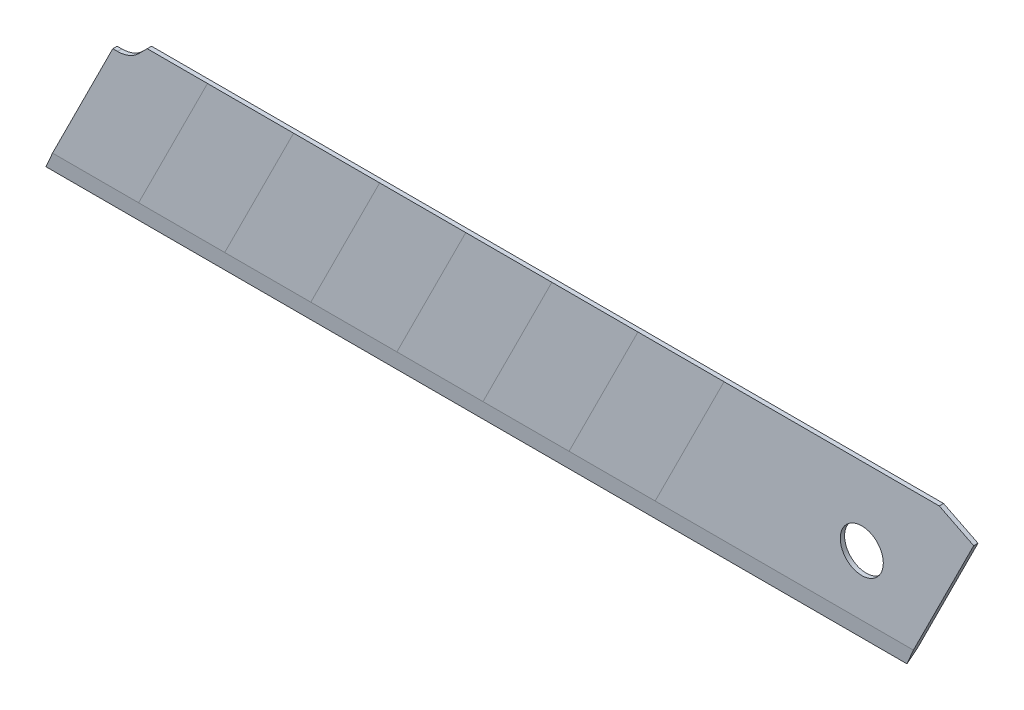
ISO-10303-21;
HEADER;
FILE_DESCRIPTION(('STEP AP214'),'2;1');
FILE_NAME('part.step','',(''),(''),'','','');
FILE_SCHEMA(('AUTOMOTIVE_DESIGN { 1 0 10303 214 1 1 1 1 }'));
ENDSEC;
DATA;
#1=APPLICATION_CONTEXT('core data for automotive mechanical design processes');
#2=APPLICATION_PROTOCOL_DEFINITION('international standard','automotive_design',2000,#1);
#3=PRODUCT_CONTEXT('',#1,'mechanical');
#4=PRODUCT('Part','Part','',(#3));
#5=PRODUCT_RELATED_PRODUCT_CATEGORY('part','',(#4));
#6=PRODUCT_DEFINITION_FORMATION('','',#4);
#7=PRODUCT_DEFINITION_CONTEXT('part definition',#1,'design');
#8=PRODUCT_DEFINITION('design','',#6,#7);
#9=PRODUCT_DEFINITION_SHAPE('','',#8);
#10=(LENGTH_UNIT() NAMED_UNIT(*) SI_UNIT(.MILLI.,.METRE.));
#11=(NAMED_UNIT(*) PLANE_ANGLE_UNIT() SI_UNIT($,.RADIAN.));
#12=(NAMED_UNIT(*) SI_UNIT($,.STERADIAN.) SOLID_ANGLE_UNIT());
#13=UNCERTAINTY_MEASURE_WITH_UNIT(LENGTH_MEASURE(1.E-05),#10,'distance_accuracy_value','');
#14=(GEOMETRIC_REPRESENTATION_CONTEXT(3) GLOBAL_UNCERTAINTY_ASSIGNED_CONTEXT((#13)) GLOBAL_UNIT_ASSIGNED_CONTEXT((#10,
#11,#12)) REPRESENTATION_CONTEXT('',''));
#15=CARTESIAN_POINT('',(0.,0.,0.));
#16=DIRECTION('',(0.,0.,1.));
#17=DIRECTION('',(1.,0.,0.));
#18=AXIS2_PLACEMENT_3D('',#15,#16,#17);
#19=CARTESIAN_POINT('',(0.,0.,0.5));
#20=DIRECTION('',(0.,0.,-1.));
#21=DIRECTION('',(-1.,0.,0.));
#22=AXIS2_PLACEMENT_3D('',#19,#20,#21);
#23=PLANE('',#22);
#24=DIRECTION('',(-0.447213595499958,-0.894427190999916,0.));
#25=VECTOR('',#24,1.);
#26=CARTESIAN_POINT('',(56.,-28.,0.5));
#27=LINE('',#26,#25);
#28=CARTESIAN_POINT('',(79.,18.,0.5));
#29=VERTEX_POINT('',#28);
#30=CARTESIAN_POINT('',(71.,2.00000000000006,0.5));
#31=VERTEX_POINT('',#30);
#32=EDGE_CURVE('E12',#29,#31,#27,.T.);
#33=ORIENTED_EDGE('',*,*,#32,.F.);
#34=DIRECTION('',(-1.,0.,0.));
#35=VECTOR('',#34,1.);
#36=CARTESIAN_POINT('',(9.,18.,0.5));
#37=LINE('',#36,#35);
#38=CARTESIAN_POINT('',(69.,18.,0.5));
#39=VERTEX_POINT('',#38);
#40=EDGE_CURVE('E218',#29,#39,#37,.T.);
#41=ORIENTED_EDGE('',*,*,#40,.T.);
#42=DIRECTION('',(-0.447213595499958,-0.894427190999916,0.));
#43=VECTOR('',#42,1.);
#44=CARTESIAN_POINT('',(48.,-24.,0.5));
#45=LINE('',#44,#43);
#46=CARTESIAN_POINT('',(61.,2.00000000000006,0.5));
#47=VERTEX_POINT('',#46);
#48=EDGE_CURVE('E45',#39,#47,#45,.T.);
#49=ORIENTED_EDGE('',*,*,#48,.T.);
#50=DIRECTION('',(1.,0.,0.));
#51=VECTOR('',#50,1.);
#52=CARTESIAN_POINT('',(0.,2.00000000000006,0.5));
#53=LINE('',#52,#51);
#54=EDGE_CURVE('E271',#47,#31,#53,.T.);
#55=ORIENTED_EDGE('',*,*,#54,.T.);
#56=EDGE_LOOP('',(#33,#41,#49,#55));
#57=FACE_BOUND('',#56,.T.);
#58=ADVANCED_FACE('F36',(#57),#23,.F.);
#59=ORIENTED_EDGE('',*,*,#48,.F.);
#60=CARTESIAN_POINT('',(59.,18.,0.5));
#61=VERTEX_POINT('',#60);
#62=EDGE_CURVE('E339',#39,#61,#37,.T.);
#63=ORIENTED_EDGE('',*,*,#62,.T.);
#64=DIRECTION('',(-0.447213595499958,-0.894427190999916,0.));
#65=VECTOR('',#64,1.);
#66=CARTESIAN_POINT('',(40.,-20.,0.5));
#67=LINE('',#66,#65);
#68=CARTESIAN_POINT('',(51.,2.00000000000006,0.5));
#69=VERTEX_POINT('',#68);
#70=EDGE_CURVE('E264',#61,#69,#67,.T.);
#71=ORIENTED_EDGE('',*,*,#70,.T.);
#72=EDGE_CURVE('E279',#69,#47,#53,.T.);
#73=ORIENTED_EDGE('',*,*,#72,.T.);
#74=EDGE_LOOP('',(#59,#63,#71,#73));
#75=FACE_BOUND('',#74,.T.);
#76=ADVANCED_FACE('F282',(#75),#23,.F.);
#77=ORIENTED_EDGE('',*,*,#70,.F.);
#78=CARTESIAN_POINT('',(49.,18.,0.5));
#79=VERTEX_POINT('',#78);
#80=EDGE_CURVE('E337',#61,#79,#37,.T.);
#81=ORIENTED_EDGE('',*,*,#80,.T.);
#82=DIRECTION('',(-0.447213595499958,-0.894427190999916,0.));
#83=VECTOR('',#82,1.);
#84=CARTESIAN_POINT('',(32.,-16.,0.5));
#85=LINE('',#84,#83);
#86=CARTESIAN_POINT('',(41.,2.00000000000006,0.5));
#87=VERTEX_POINT('',#86);
#88=EDGE_CURVE('E261',#79,#87,#85,.T.);
#89=ORIENTED_EDGE('',*,*,#88,.T.);
#90=EDGE_CURVE('E284',#87,#69,#53,.T.);
#91=ORIENTED_EDGE('',*,*,#90,.T.);
#92=EDGE_LOOP('',(#77,#81,#89,#91));
#93=FACE_BOUND('',#92,.T.);
#94=ADVANCED_FACE('F341',(#93),#23,.F.);
#95=ORIENTED_EDGE('',*,*,#88,.F.);
#96=CARTESIAN_POINT('',(39.,18.,0.5));
#97=VERTEX_POINT('',#96);
#98=EDGE_CURVE('E336',#79,#97,#37,.T.);
#99=ORIENTED_EDGE('',*,*,#98,.T.);
#100=DIRECTION('',(-0.447213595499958,-0.894427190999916,0.));
#101=VECTOR('',#100,1.);
#102=CARTESIAN_POINT('',(24.,-12.,0.5));
#103=LINE('',#102,#101);
#104=CARTESIAN_POINT('',(31.,2.00000000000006,0.5));
#105=VERTEX_POINT('',#104);
#106=EDGE_CURVE('E258',#97,#105,#103,.T.);
#107=ORIENTED_EDGE('',*,*,#106,.T.);
#108=EDGE_CURVE('E285',#105,#87,#53,.T.);
#109=ORIENTED_EDGE('',*,*,#108,.T.);
#110=EDGE_LOOP('',(#95,#99,#107,#109));
#111=FACE_BOUND('',#110,.T.);
#112=ADVANCED_FACE('F343',(#111),#23,.F.);
#113=ORIENTED_EDGE('',*,*,#106,.F.);
#114=CARTESIAN_POINT('',(29.,18.,0.5));
#115=VERTEX_POINT('',#114);
#116=EDGE_CURVE('E335',#97,#115,#37,.T.);
#117=ORIENTED_EDGE('',*,*,#116,.T.);
#118=DIRECTION('',(-0.447213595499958,-0.894427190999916,0.));
#119=VECTOR('',#118,1.);
#120=CARTESIAN_POINT('',(16.,-8.00000000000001,0.5));
#121=LINE('',#120,#119);
#122=CARTESIAN_POINT('',(21.,2.00000000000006,0.5));
#123=VERTEX_POINT('',#122);
#124=EDGE_CURVE('E255',#115,#123,#121,.T.);
#125=ORIENTED_EDGE('',*,*,#124,.T.);
#126=EDGE_CURVE('E288',#123,#105,#53,.T.);
#127=ORIENTED_EDGE('',*,*,#126,.T.);
#128=EDGE_LOOP('',(#113,#117,#125,#127));
#129=FACE_BOUND('',#128,.T.);
#130=ADVANCED_FACE('F349',(#129),#23,.F.);
#131=ORIENTED_EDGE('',*,*,#124,.F.);
#132=CARTESIAN_POINT('',(19.,18.,0.5));
#133=VERTEX_POINT('',#132);
#134=EDGE_CURVE('E334',#115,#133,#37,.T.);
#135=ORIENTED_EDGE('',*,*,#134,.T.);
#136=DIRECTION('',(-0.447213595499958,-0.894427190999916,0.));
#137=VECTOR('',#136,1.);
#138=CARTESIAN_POINT('',(8.,-4.,0.5));
#139=LINE('',#138,#137);
#140=CARTESIAN_POINT('',(11.,2.00000000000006,0.5));
#141=VERTEX_POINT('',#140);
#142=EDGE_CURVE('E251',#133,#141,#139,.T.);
#143=ORIENTED_EDGE('',*,*,#142,.T.);
#144=EDGE_CURVE('E252',#141,#123,#53,.T.);
#145=ORIENTED_EDGE('',*,*,#144,.T.);
#146=EDGE_LOOP('',(#131,#135,#143,#145));
#147=FACE_BOUND('',#146,.T.);
#148=ADVANCED_FACE('F300',(#147),#23,.F.);
#149=ORIENTED_EDGE('',*,*,#142,.F.);
#150=CARTESIAN_POINT('',(12.,18.,0.5));
#151=VERTEX_POINT('',#150);
#152=EDGE_CURVE('E214',#133,#151,#37,.T.);
#153=ORIENTED_EDGE('',*,*,#152,.T.);
#154=DIRECTION('',(0.707106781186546,0.707106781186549,0.));
#155=VECTOR('',#154,1.);
#156=CARTESIAN_POINT('',(11.0251262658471,17.0251262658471,0.5));
#157=LINE('',#156,#155);
#158=CARTESIAN_POINT('',(11.0251262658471,17.0251262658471,0.5));
#159=VERTEX_POINT('',#158);
#160=EDGE_CURVE('E180',#159,#151,#157,.T.);
#161=ORIENTED_EDGE('',*,*,#160,.F.);
#162=CARTESIAN_POINT('',(8.55025253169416,19.5,0.5));
#163=DIRECTION('',(0.,0.,1.));
#164=DIRECTION('',(1.,0.,0.));
#165=AXIS2_PLACEMENT_3D('',#162,#163,#164);
#166=CIRCLE('',#165,3.5);
#167=CARTESIAN_POINT('',(8.55025253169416,16.,0.5));
#168=VERTEX_POINT('',#167);
#169=EDGE_CURVE('E183',#168,#159,#166,.T.);
#170=ORIENTED_EDGE('',*,*,#169,.F.);
#171=DIRECTION('',(1.,0.,0.));
#172=VECTOR('',#171,1.);
#173=CARTESIAN_POINT('',(8.,16.,0.5));
#174=LINE('',#173,#172);
#175=CARTESIAN_POINT('',(8.,16.,0.5));
#176=VERTEX_POINT('',#175);
#177=EDGE_CURVE('E159',#176,#168,#174,.T.);
#178=ORIENTED_EDGE('',*,*,#177,.F.);
#179=DIRECTION('',(-0.447213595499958,-0.894427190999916,0.));
#180=VECTOR('',#179,1.);
#181=CARTESIAN_POINT('',(0.,0.,0.5));
#182=LINE('',#181,#180);
#183=CARTESIAN_POINT('',(1.00000000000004,2.00000000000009,0.500000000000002));
#184=VERTEX_POINT('',#183);
#185=EDGE_CURVE('E217',#176,#184,#182,.T.);
#186=ORIENTED_EDGE('',*,*,#185,.T.);
#187=EDGE_CURVE('E248',#184,#141,#53,.T.);
#188=ORIENTED_EDGE('',*,*,#187,.T.);
#189=EDGE_LOOP('',(#149,#153,#161,#170,#178,#186,#188));
#190=FACE_BOUND('',#189,.T.);
#191=ADVANCED_FACE('F305',(#190),#23,.F.);
#192=CARTESIAN_POINT('',(104.,18.,0.5));
#193=VERTEX_POINT('',#192);
#194=EDGE_CURVE('E215',#193,#29,#37,.T.);
#195=ORIENTED_EDGE('',*,*,#194,.T.);
#196=ORIENTED_EDGE('',*,*,#32,.T.);
#197=CARTESIAN_POINT('',(101.,1.9999999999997,0.499999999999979));
#198=VERTEX_POINT('',#197);
#199=EDGE_CURVE('E247',#31,#198,#53,.T.);
#200=ORIENTED_EDGE('',*,*,#199,.T.);
#201=DIRECTION('',(0.447213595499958,0.894427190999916,0.));
#202=VECTOR('',#201,1.);
#203=CARTESIAN_POINT('',(109.,18.,0.5));
#204=LINE('',#203,#202);
#205=CARTESIAN_POINT('',(108.,16.,0.5));
#206=VERTEX_POINT('',#205);
#207=EDGE_CURVE('E212',#198,#206,#204,.T.);
#208=ORIENTED_EDGE('',*,*,#207,.T.);
#209=DIRECTION('',(0.894427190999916,-0.447213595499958,0.));
#210=VECTOR('',#209,1.);
#211=CARTESIAN_POINT('',(104.,18.,0.5));
#212=LINE('',#211,#210);
#213=EDGE_CURVE('E192',#193,#206,#212,.T.);
#214=ORIENTED_EDGE('',*,*,#213,.F.);
#215=EDGE_LOOP('',(#195,#196,#200,#208,#214));
#216=FACE_BOUND('',#215,.T.);
#217=CARTESIAN_POINT('',(95.,9.,0.5));
#218=DIRECTION('',(0.,0.,1.));
#219=DIRECTION('',(1.,0.,0.));
#220=AXIS2_PLACEMENT_3D('',#217,#218,#219);
#221=CIRCLE('',#220,2.5);
#222=CARTESIAN_POINT('',(97.5,9.,0.5));
#223=VERTEX_POINT('',#222);
#224=EDGE_CURVE('E206',#223,#223,#221,.T.);
#225=ORIENTED_EDGE('',*,*,#224,.F.);
#226=EDGE_LOOP('',(#225));
#227=FACE_BOUND('',#226,.T.);
#228=ADVANCED_FACE('F321',(#216,#227),#23,.F.);
#229=CARTESIAN_POINT('',(0.,0.,0.));
#230=DIRECTION('',(0.,0.,-1.));
#231=DIRECTION('',(-1.,0.,0.));
#232=AXIS2_PLACEMENT_3D('',#229,#230,#231);
#233=PLANE('',#232);
#234=DIRECTION('',(0.447213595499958,0.894427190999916,0.));
#235=VECTOR('',#234,1.);
#236=CARTESIAN_POINT('',(109.,18.,0.));
#237=LINE('',#236,#235);
#238=CARTESIAN_POINT('',(101.,2.00000000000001,0.));
#239=VERTEX_POINT('',#238);
#240=CARTESIAN_POINT('',(108.,16.,0.));
#241=VERTEX_POINT('',#240);
#242=EDGE_CURVE('E209',#239,#241,#237,.T.);
#243=ORIENTED_EDGE('',*,*,#242,.F.);
#244=DIRECTION('',(-1.,0.,0.));
#245=VECTOR('',#244,1.);
#246=CARTESIAN_POINT('',(0.,2.,0.));
#247=LINE('',#246,#245);
#248=CARTESIAN_POINT('',(0.999999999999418,1.99999999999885,0.));
#249=VERTEX_POINT('',#248);
#250=EDGE_CURVE('E241',#239,#249,#247,.T.);
#251=ORIENTED_EDGE('',*,*,#250,.T.);
#252=DIRECTION('',(-0.447213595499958,-0.894427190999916,0.));
#253=VECTOR('',#252,1.);
#254=CARTESIAN_POINT('',(0.,0.,0.));
#255=LINE('',#254,#253);
#256=CARTESIAN_POINT('',(7.99999999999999,16.,0.));
#257=VERTEX_POINT('',#256);
#258=EDGE_CURVE('E179',#257,#249,#255,.T.);
#259=ORIENTED_EDGE('',*,*,#258,.F.);
#260=DIRECTION('',(1.,0.,0.));
#261=VECTOR('',#260,1.);
#262=CARTESIAN_POINT('',(8.,16.,0.));
#263=LINE('',#262,#261);
#264=CARTESIAN_POINT('',(8.55025253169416,16.,0.));
#265=VERTEX_POINT('',#264);
#266=EDGE_CURVE('E156',#257,#265,#263,.T.);
#267=ORIENTED_EDGE('',*,*,#266,.T.);
#268=CARTESIAN_POINT('',(8.55025253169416,19.5,0.));
#269=DIRECTION('',(0.,0.,1.));
#270=DIRECTION('',(1.,0.,0.));
#271=AXIS2_PLACEMENT_3D('',#268,#269,#270);
#272=CIRCLE('',#271,3.5);
#273=CARTESIAN_POINT('',(11.0251262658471,17.0251262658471,0.));
#274=VERTEX_POINT('',#273);
#275=EDGE_CURVE('E167',#265,#274,#272,.T.);
#276=ORIENTED_EDGE('',*,*,#275,.T.);
#277=DIRECTION('',(0.707106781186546,0.707106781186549,0.));
#278=VECTOR('',#277,1.);
#279=CARTESIAN_POINT('',(11.0251262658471,17.0251262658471,0.));
#280=LINE('',#279,#278);
#281=CARTESIAN_POINT('',(12.,18.,0.));
#282=VERTEX_POINT('',#281);
#283=EDGE_CURVE('E172',#274,#282,#280,.T.);
#284=ORIENTED_EDGE('',*,*,#283,.T.);
#285=DIRECTION('',(-1.,0.,0.));
#286=VECTOR('',#285,1.);
#287=CARTESIAN_POINT('',(9.,18.,0.));
#288=LINE('',#287,#286);
#289=CARTESIAN_POINT('',(104.,18.,0.));
#290=VERTEX_POINT('',#289);
#291=EDGE_CURVE('E223',#290,#282,#288,.T.);
#292=ORIENTED_EDGE('',*,*,#291,.F.);
#293=DIRECTION('',(0.894427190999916,-0.447213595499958,0.));
#294=VECTOR('',#293,1.);
#295=CARTESIAN_POINT('',(104.,18.,0.));
#296=LINE('',#295,#294);
#297=EDGE_CURVE('E195',#290,#241,#296,.T.);
#298=ORIENTED_EDGE('',*,*,#297,.T.);
#299=EDGE_LOOP('',(#243,#251,#259,#267,#276,#284,#292,#298));
#300=FACE_BOUND('',#299,.T.);
#301=CARTESIAN_POINT('',(95.,9.,0.));
#302=DIRECTION('',(0.,0.,1.));
#303=DIRECTION('',(1.,0.,0.));
#304=AXIS2_PLACEMENT_3D('',#301,#302,#303);
#305=CIRCLE('',#304,2.5);
#306=CARTESIAN_POINT('',(97.5,9.,0.));
#307=VERTEX_POINT('',#306);
#308=EDGE_CURVE('E204',#307,#307,#305,.T.);
#309=ORIENTED_EDGE('',*,*,#308,.T.);
#310=EDGE_LOOP('',(#309));
#311=FACE_BOUND('',#310,.T.);
#312=ADVANCED_FACE('F176',(#300,#311),#233,.T.);
#313=CARTESIAN_POINT('',(100.,0.,0.5));
#314=DIRECTION('',(0.,1.,0.));
#315=DIRECTION('',(0.,0.,1.));
#316=AXIS2_PLACEMENT_3D('',#313,#314,#315);
#317=PLANE('',#316);
#318=DIRECTION('',(0.,0.,-1.));
#319=VECTOR('',#318,1.);
#320=CARTESIAN_POINT('',(0.,0.,0.5));
#321=LINE('',#320,#319);
#322=CARTESIAN_POINT('',(0.,0.,0.259999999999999));
#323=VERTEX_POINT('',#322);
#324=CARTESIAN_POINT('',(0.,0.,0.240000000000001));
#325=VERTEX_POINT('',#324);
#326=EDGE_CURVE('E221',#323,#325,#321,.T.);
#327=ORIENTED_EDGE('',*,*,#326,.T.);
#328=DIRECTION('',(1.,0.,0.));
#329=VECTOR('',#328,1.);
#330=CARTESIAN_POINT('',(100.,0.,0.24));
#331=LINE('',#330,#329);
#332=CARTESIAN_POINT('',(100.,0.,0.24));
#333=VERTEX_POINT('',#332);
#334=EDGE_CURVE('E234',#325,#333,#331,.T.);
#335=ORIENTED_EDGE('',*,*,#334,.T.);
#336=DIRECTION('',(0.,0.,-1.));
#337=VECTOR('',#336,1.);
#338=CARTESIAN_POINT('',(100.,0.,0.5));
#339=LINE('',#338,#337);
#340=CARTESIAN_POINT('',(100.,0.,0.259999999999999));
#341=VERTEX_POINT('',#340);
#342=EDGE_CURVE('E229',#341,#333,#339,.T.);
#343=ORIENTED_EDGE('',*,*,#342,.F.);
#344=DIRECTION('',(-1.,0.,0.));
#345=VECTOR('',#344,1.);
#346=CARTESIAN_POINT('',(100.,0.,0.259999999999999));
#347=LINE('',#346,#345);
#348=EDGE_CURVE('E232',#341,#323,#347,.T.);
#349=ORIENTED_EDGE('',*,*,#348,.T.);
#350=EDGE_LOOP('',(#327,#335,#343,#349));
#351=FACE_BOUND('',#350,.T.);
#352=ADVANCED_FACE('F315',(#351),#317,.F.);
#353=CARTESIAN_POINT('',(109.,18.,0.5));
#354=DIRECTION('',(-0.894427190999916,0.447213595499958,0.));
#355=DIRECTION('',(-0.447213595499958,-0.894427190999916,0.));
#356=AXIS2_PLACEMENT_3D('',#353,#354,#355);
#357=PLANE('',#356);
#358=ORIENTED_EDGE('',*,*,#342,.T.);
#359=DIRECTION('',(0.444659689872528,0.889319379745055,-0.106718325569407));
#360=VECTOR('',#359,1.);
#361=CARTESIAN_POINT('',(100.,0.,0.24));
#362=LINE('',#361,#360);
#363=EDGE_CURVE('E239',#333,#239,#362,.T.);
#364=ORIENTED_EDGE('',*,*,#363,.T.);
#365=ORIENTED_EDGE('',*,*,#242,.T.);
#366=DIRECTION('',(0.,0.,1.));
#367=VECTOR('',#366,1.);
#368=CARTESIAN_POINT('',(108.,16.,0.));
#369=LINE('',#368,#367);
#370=EDGE_CURVE('E201',#241,#206,#369,.T.);
#371=ORIENTED_EDGE('',*,*,#370,.T.);
#372=ORIENTED_EDGE('',*,*,#207,.F.);
#373=DIRECTION('',(0.444659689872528,0.889319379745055,0.106718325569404));
#374=VECTOR('',#373,1.);
#375=CARTESIAN_POINT('',(81.0300537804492,-37.9398924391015,-4.29278709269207));
#376=LINE('',#375,#374);
#377=EDGE_CURVE('E237',#198,#341,#376,.F.);
#378=ORIENTED_EDGE('',*,*,#377,.T.);
#379=EDGE_LOOP('',(#358,#364,#365,#371,#372,#378));
#380=FACE_BOUND('',#379,.T.);
#381=ADVANCED_FACE('F318',(#380),#357,.F.);
#382=CARTESIAN_POINT('',(9.,18.,0.5));
#383=DIRECTION('',(0.,-1.,0.));
#384=DIRECTION('',(0.,0.,-1.));
#385=AXIS2_PLACEMENT_3D('',#382,#383,#384);
#386=PLANE('',#385);
#387=ORIENTED_EDGE('',*,*,#291,.T.);
#388=DIRECTION('',(0.,0.,1.));
#389=VECTOR('',#388,1.);
#390=CARTESIAN_POINT('',(12.,18.,0.));
#391=LINE('',#390,#389);
#392=EDGE_CURVE('E189',#282,#151,#391,.T.);
#393=ORIENTED_EDGE('',*,*,#392,.T.);
#394=ORIENTED_EDGE('',*,*,#152,.F.);
#395=ORIENTED_EDGE('',*,*,#134,.F.);
#396=ORIENTED_EDGE('',*,*,#116,.F.);
#397=ORIENTED_EDGE('',*,*,#98,.F.);
#398=ORIENTED_EDGE('',*,*,#80,.F.);
#399=ORIENTED_EDGE('',*,*,#62,.F.);
#400=ORIENTED_EDGE('',*,*,#40,.F.);
#401=ORIENTED_EDGE('',*,*,#194,.F.);
#402=DIRECTION('',(0.,0.,1.));
#403=VECTOR('',#402,1.);
#404=CARTESIAN_POINT('',(104.,18.,0.));
#405=LINE('',#404,#403);
#406=EDGE_CURVE('E198',#290,#193,#405,.T.);
#407=ORIENTED_EDGE('',*,*,#406,.F.);
#408=EDGE_LOOP('',(#387,#393,#394,#395,#396,#397,#398,#399,#400,#401,#407));
#409=FACE_BOUND('',#408,.T.);
#410=ADVANCED_FACE('F329',(#409),#386,.F.);
#411=CARTESIAN_POINT('',(0.,0.,0.5));
#412=DIRECTION('',(0.894427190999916,-0.447213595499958,0.));
#413=DIRECTION('',(0.447213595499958,0.894427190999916,0.));
#414=AXIS2_PLACEMENT_3D('',#411,#412,#413);
#415=PLANE('',#414);
#416=ORIENTED_EDGE('',*,*,#258,.T.);
#417=DIRECTION('',(-0.444659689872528,-0.889319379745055,0.106718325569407));
#418=VECTOR('',#417,1.);
#419=CARTESIAN_POINT('',(19.7722239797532,39.5444479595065,-4.50533375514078));
#420=LINE('',#419,#418);
#421=EDGE_CURVE('E245',#249,#325,#420,.T.);
#422=ORIENTED_EDGE('',*,*,#421,.T.);
#423=ORIENTED_EDGE('',*,*,#326,.F.);
#424=DIRECTION('',(-0.444659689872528,-0.889319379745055,-0.106718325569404));
#425=VECTOR('',#424,1.);
#426=CARTESIAN_POINT('',(0.802277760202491,1.60455552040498,0.452546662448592));
#427=LINE('',#426,#425);
#428=EDGE_CURVE('E243',#323,#184,#427,.F.);
#429=ORIENTED_EDGE('',*,*,#428,.T.);
#430=ORIENTED_EDGE('',*,*,#185,.F.);
#431=DIRECTION('',(0.,0.,1.));
#432=VECTOR('',#431,1.);
#433=CARTESIAN_POINT('',(8.,16.,0.));
#434=LINE('',#433,#432);
#435=EDGE_CURVE('E164',#257,#176,#434,.T.);
#436=ORIENTED_EDGE('',*,*,#435,.F.);
#437=EDGE_LOOP('',(#416,#422,#423,#429,#430,#436));
#438=FACE_BOUND('',#437,.T.);
#439=ADVANCED_FACE('F309',(#438),#415,.F.);
#440=CARTESIAN_POINT('',(95.,9.,0.5));
#441=DIRECTION('',(0.,0.,-1.));
#442=DIRECTION('',(-1.,0.,0.));
#443=AXIS2_PLACEMENT_3D('',#440,#441,#442);
#444=CYLINDRICAL_SURFACE('',#443,2.5);
#445=ORIENTED_EDGE('',*,*,#224,.T.);
#446=EDGE_LOOP('',(#445));
#447=FACE_BOUND('',#446,.T.);
#448=ORIENTED_EDGE('',*,*,#308,.F.);
#449=EDGE_LOOP('',(#448));
#450=FACE_BOUND('',#449,.T.);
#451=ADVANCED_FACE('F436',(#447,#450),#444,.F.);
#452=CARTESIAN_POINT('',(104.,18.,0.));
#453=DIRECTION('',(-0.447213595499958,-0.894427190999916,0.));
#454=DIRECTION('',(0.894427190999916,-0.447213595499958,0.));
#455=AXIS2_PLACEMENT_3D('',#452,#453,#454);
#456=PLANE('',#455);
#457=ORIENTED_EDGE('',*,*,#213,.T.);
#458=ORIENTED_EDGE('',*,*,#370,.F.);
#459=ORIENTED_EDGE('',*,*,#297,.F.);
#460=ORIENTED_EDGE('',*,*,#406,.T.);
#461=EDGE_LOOP('',(#457,#458,#459,#460));
#462=FACE_BOUND('',#461,.T.);
#463=ADVANCED_FACE('F325',(#462),#456,.F.);
#464=CARTESIAN_POINT('',(11.0251262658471,17.0251262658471,0.));
#465=DIRECTION('',(0.70710678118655,-0.707106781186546,0.));
#466=DIRECTION('',(0.707106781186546,0.70710678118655,0.));
#467=AXIS2_PLACEMENT_3D('',#464,#465,#466);
#468=PLANE('',#467);
#469=ORIENTED_EDGE('',*,*,#160,.T.);
#470=ORIENTED_EDGE('',*,*,#392,.F.);
#471=ORIENTED_EDGE('',*,*,#283,.F.);
#472=DIRECTION('',(0.,0.,1.));
#473=VECTOR('',#472,1.);
#474=CARTESIAN_POINT('',(11.0251262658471,17.0251262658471,0.));
#475=LINE('',#474,#473);
#476=EDGE_CURVE('E163',#274,#159,#475,.T.);
#477=ORIENTED_EDGE('',*,*,#476,.T.);
#478=EDGE_LOOP('',(#469,#470,#471,#477));
#479=FACE_BOUND('',#478,.T.);
#480=ADVANCED_FACE('F331',(#479),#468,.F.);
#481=CARTESIAN_POINT('',(8.55025253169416,19.5,0.));
#482=DIRECTION('',(0.,0.,1.));
#483=DIRECTION('',(1.,0.,0.));
#484=AXIS2_PLACEMENT_3D('',#481,#482,#483);
#485=CYLINDRICAL_SURFACE('',#484,3.5);
#486=ORIENTED_EDGE('',*,*,#169,.T.);
#487=ORIENTED_EDGE('',*,*,#476,.F.);
#488=ORIENTED_EDGE('',*,*,#275,.F.);
#489=DIRECTION('',(0.,0.,1.));
#490=VECTOR('',#489,1.);
#491=CARTESIAN_POINT('',(8.55025253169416,16.,0.));
#492=LINE('',#491,#490);
#493=EDGE_CURVE('E152',#265,#168,#492,.T.);
#494=ORIENTED_EDGE('',*,*,#493,.T.);
#495=EDGE_LOOP('',(#486,#487,#488,#494));
#496=FACE_BOUND('',#495,.T.);
#497=ADVANCED_FACE('F168',(#496),#485,.F.);
#498=CARTESIAN_POINT('',(8.,16.,0.));
#499=DIRECTION('',(0.,-1.,0.));
#500=DIRECTION('',(1.,0.,0.));
#501=AXIS2_PLACEMENT_3D('',#498,#499,#500);
#502=PLANE('',#501);
#503=ORIENTED_EDGE('',*,*,#177,.T.);
#504=ORIENTED_EDGE('',*,*,#493,.F.);
#505=ORIENTED_EDGE('',*,*,#266,.F.);
#506=ORIENTED_EDGE('',*,*,#435,.T.);
#507=EDGE_LOOP('',(#503,#504,#505,#506));
#508=FACE_BOUND('',#507,.T.);
#509=ADVANCED_FACE('F154',(#508),#502,.F.);
#510=CARTESIAN_POINT('',(100.,0.,0.24));
#511=DIRECTION('',(0.,-0.119145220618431,-0.992876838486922));
#512=DIRECTION('',(-1.,0.,0.));
#513=AXIS2_PLACEMENT_3D('',#510,#511,#512);
#514=PLANE('',#513);
#515=ORIENTED_EDGE('',*,*,#421,.F.);
#516=ORIENTED_EDGE('',*,*,#250,.F.);
#517=ORIENTED_EDGE('',*,*,#363,.F.);
#518=ORIENTED_EDGE('',*,*,#334,.F.);
#519=EDGE_LOOP('',(#515,#516,#517,#518));
#520=FACE_BOUND('',#519,.T.);
#521=ADVANCED_FACE('F408',(#520),#514,.T.);
#522=CARTESIAN_POINT('',(0.,2.00000000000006,0.5));
#523=DIRECTION('',(0.,0.119145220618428,-0.992876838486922));
#524=DIRECTION('',(1.,0.,0.));
#525=AXIS2_PLACEMENT_3D('',#522,#523,#524);
#526=PLANE('',#525);
#527=ORIENTED_EDGE('',*,*,#428,.F.);
#528=ORIENTED_EDGE('',*,*,#348,.F.);
#529=ORIENTED_EDGE('',*,*,#377,.F.);
#530=ORIENTED_EDGE('',*,*,#199,.F.);
#531=ORIENTED_EDGE('',*,*,#54,.F.);
#532=ORIENTED_EDGE('',*,*,#72,.F.);
#533=ORIENTED_EDGE('',*,*,#90,.F.);
#534=ORIENTED_EDGE('',*,*,#108,.F.);
#535=ORIENTED_EDGE('',*,*,#126,.F.);
#536=ORIENTED_EDGE('',*,*,#144,.F.);
#537=ORIENTED_EDGE('',*,*,#187,.F.);
#538=EDGE_LOOP('',(#527,#528,#529,#530,#531,#532,#533,#534,#535,#536,#537));
#539=FACE_BOUND('',#538,.T.);
#540=ADVANCED_FACE('F38',(#539),#526,.F.);
#541=CLOSED_SHELL('',(#58,#76,#94,#112,#130,#148,#191,#228,#312,#352,#381,#410,#439,#451,#463,
#480,#497,#509,#521,#540));
#542=MANIFOLD_SOLID_BREP('B2',#541);
#543=ADVANCED_BREP_SHAPE_REPRESENTATION('',(#18,#542),#14);
#544=SHAPE_DEFINITION_REPRESENTATION(#9,#543);
ENDSEC;
END-ISO-10303-21;
